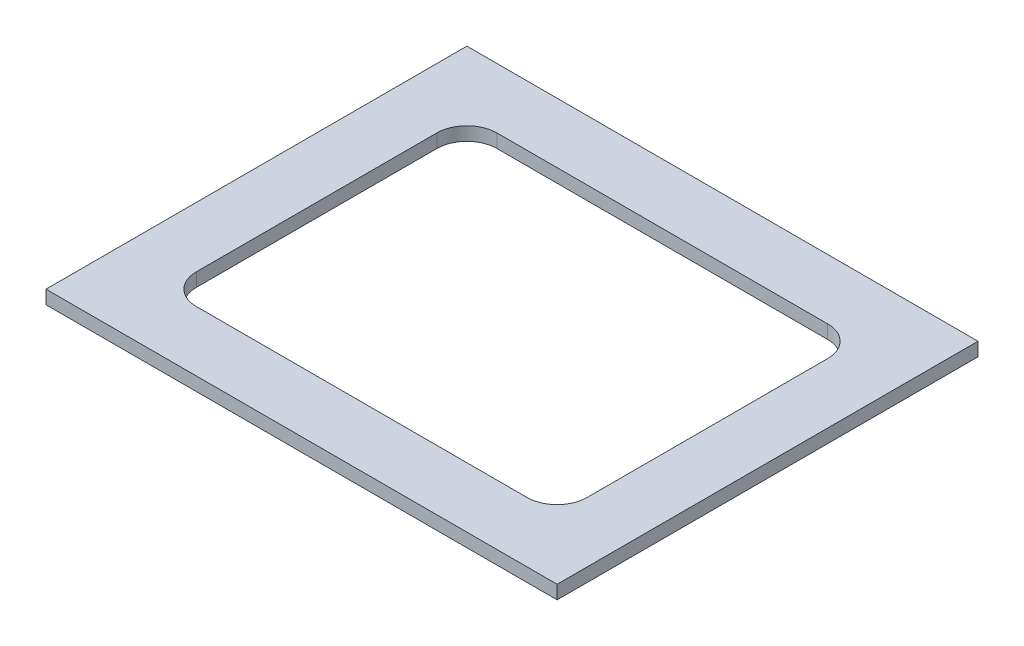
ISO-10303-21;
HEADER;
FILE_DESCRIPTION(('STEP AP214'),'2;1');
FILE_NAME('part.step','',(''),(''),'','','');
FILE_SCHEMA(('AUTOMOTIVE_DESIGN { 1 0 10303 214 1 1 1 1 }'));
ENDSEC;
DATA;
#1=APPLICATION_CONTEXT('core data for automotive mechanical design processes');
#2=APPLICATION_PROTOCOL_DEFINITION('international standard','automotive_design',2000,#1);
#3=PRODUCT_CONTEXT('',#1,'mechanical');
#4=PRODUCT('Part','Part','',(#3));
#5=PRODUCT_RELATED_PRODUCT_CATEGORY('part','',(#4));
#6=PRODUCT_DEFINITION_FORMATION('','',#4);
#7=PRODUCT_DEFINITION_CONTEXT('part definition',#1,'design');
#8=PRODUCT_DEFINITION('design','',#6,#7);
#9=PRODUCT_DEFINITION_SHAPE('','',#8);
#10=(LENGTH_UNIT() NAMED_UNIT(*) SI_UNIT(.MILLI.,.METRE.));
#11=(NAMED_UNIT(*) PLANE_ANGLE_UNIT() SI_UNIT($,.RADIAN.));
#12=(NAMED_UNIT(*) SI_UNIT($,.STERADIAN.) SOLID_ANGLE_UNIT());
#13=UNCERTAINTY_MEASURE_WITH_UNIT(LENGTH_MEASURE(1.E-05),#10,'distance_accuracy_value','');
#14=(GEOMETRIC_REPRESENTATION_CONTEXT(3) GLOBAL_UNCERTAINTY_ASSIGNED_CONTEXT((#13)) GLOBAL_UNIT_ASSIGNED_CONTEXT((#10,
#11,#12)) REPRESENTATION_CONTEXT('',''));
#15=CARTESIAN_POINT('',(0.,0.,0.));
#16=DIRECTION('',(0.,0.,1.));
#17=DIRECTION('',(1.,0.,0.));
#18=AXIS2_PLACEMENT_3D('',#15,#16,#17);
#19=CARTESIAN_POINT('',(0.,4.5,0.));
#20=DIRECTION('',(0.,1.,0.));
#21=DIRECTION('',(0.,0.,1.));
#22=AXIS2_PLACEMENT_3D('',#19,#20,#21);
#23=PLANE('',#22);
#24=DIRECTION('',(0.,0.,-1.));
#25=VECTOR('',#24,1.);
#26=CARTESIAN_POINT('',(38.6363636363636,4.5,-71.9471744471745));
#27=LINE('',#26,#25);
#28=CARTESIAN_POINT('',(38.6363636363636,4.5,68.0528255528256));
#29=VERTEX_POINT('',#28);
#30=CARTESIAN_POINT('',(38.6363636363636,4.5,-71.9471744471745));
#31=VERTEX_POINT('',#30);
#32=EDGE_CURVE('E171',#29,#31,#27,.T.);
#33=ORIENTED_EDGE('',*,*,#32,.T.);
#34=DIRECTION('',(-1.,0.,0.));
#35=VECTOR('',#34,1.);
#36=CARTESIAN_POINT('',(-131.363636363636,4.5,-71.9471744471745));
#37=LINE('',#36,#35);
#38=CARTESIAN_POINT('',(-131.363636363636,4.5,-71.9471744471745));
#39=VERTEX_POINT('',#38);
#40=EDGE_CURVE('E174',#31,#39,#37,.T.);
#41=ORIENTED_EDGE('',*,*,#40,.T.);
#42=DIRECTION('',(0.,0.,1.));
#43=VECTOR('',#42,1.);
#44=CARTESIAN_POINT('',(-131.363636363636,4.5,-71.9471744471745));
#45=LINE('',#44,#43);
#46=CARTESIAN_POINT('',(-131.363636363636,4.5,68.0528255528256));
#47=VERTEX_POINT('',#46);
#48=EDGE_CURVE('E177',#39,#47,#45,.T.);
#49=ORIENTED_EDGE('',*,*,#48,.T.);
#50=DIRECTION('',(1.,0.,0.));
#51=VECTOR('',#50,1.);
#52=CARTESIAN_POINT('',(-131.363636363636,4.5,68.0528255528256));
#53=LINE('',#52,#51);
#54=EDGE_CURVE('E179',#47,#29,#53,.T.);
#55=ORIENTED_EDGE('',*,*,#54,.T.);
#56=EDGE_LOOP('',(#33,#41,#49,#55));
#57=FACE_BOUND('',#56,.T.);
#58=DIRECTION('',(1.,0.,0.));
#59=VECTOR('',#58,1.);
#60=CARTESIAN_POINT('',(-101.363636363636,4.5,48.0528255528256));
#61=LINE('',#60,#59);
#62=CARTESIAN_POINT('',(-101.363636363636,4.5,48.0528255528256));
#63=VERTEX_POINT('',#62);
#64=CARTESIAN_POINT('',(8.63636363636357,4.5,48.0528255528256));
#65=VERTEX_POINT('',#64);
#66=EDGE_CURVE('E114',#63,#65,#61,.T.);
#67=ORIENTED_EDGE('',*,*,#66,.F.);
#68=CARTESIAN_POINT('',(-101.363636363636,4.5,38.0528255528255));
#69=DIRECTION('',(0.,1.,0.));
#70=DIRECTION('',(0.,0.,-1.));
#71=AXIS2_PLACEMENT_3D('',#68,#69,#70);
#72=CIRCLE('',#71,10.);
#73=CARTESIAN_POINT('',(-111.363636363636,4.5,38.0528255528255));
#74=VERTEX_POINT('',#73);
#75=EDGE_CURVE('E106',#74,#63,#72,.T.);
#76=ORIENTED_EDGE('',*,*,#75,.F.);
#77=DIRECTION('',(0.,0.,1.));
#78=VECTOR('',#77,1.);
#79=CARTESIAN_POINT('',(-111.363636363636,4.5,38.0528255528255));
#80=LINE('',#79,#78);
#81=CARTESIAN_POINT('',(-111.363636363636,4.5,-41.9471744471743));
#82=VERTEX_POINT('',#81);
#83=EDGE_CURVE('E139',#82,#74,#80,.T.);
#84=ORIENTED_EDGE('',*,*,#83,.F.);
#85=CARTESIAN_POINT('',(-101.363636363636,4.5,-41.9471744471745));
#86=DIRECTION('',(0.,1.,0.));
#87=DIRECTION('',(0.,0.,-1.));
#88=AXIS2_PLACEMENT_3D('',#85,#86,#87);
#89=CIRCLE('',#88,10.);
#90=CARTESIAN_POINT('',(-101.363636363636,4.5,-51.9471744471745));
#91=VERTEX_POINT('',#90);
#92=EDGE_CURVE('E137',#91,#82,#89,.T.);
#93=ORIENTED_EDGE('',*,*,#92,.F.);
#94=DIRECTION('',(-1.,0.,0.));
#95=VECTOR('',#94,1.);
#96=CARTESIAN_POINT('',(-101.363636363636,4.5,-51.9471744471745));
#97=LINE('',#96,#95);
#98=CARTESIAN_POINT('',(8.63636363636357,4.5,-51.9471744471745));
#99=VERTEX_POINT('',#98);
#100=EDGE_CURVE('E135',#99,#91,#97,.T.);
#101=ORIENTED_EDGE('',*,*,#100,.F.);
#102=CARTESIAN_POINT('',(8.63636363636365,4.5,-41.9471744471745));
#103=DIRECTION('',(0.,1.,0.));
#104=DIRECTION('',(0.,0.,-1.));
#105=AXIS2_PLACEMENT_3D('',#102,#103,#104);
#106=CIRCLE('',#105,10.);
#107=CARTESIAN_POINT('',(18.6363636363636,4.5,-41.9471744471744));
#108=VERTEX_POINT('',#107);
#109=EDGE_CURVE('E133',#108,#99,#106,.T.);
#110=ORIENTED_EDGE('',*,*,#109,.F.);
#111=DIRECTION('',(0.,0.,-1.));
#112=VECTOR('',#111,1.);
#113=CARTESIAN_POINT('',(18.6363636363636,4.5,38.0528255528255));
#114=LINE('',#113,#112);
#115=CARTESIAN_POINT('',(18.6363636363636,4.5,38.0528255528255));
#116=VERTEX_POINT('',#115);
#117=EDGE_CURVE('E129',#116,#108,#114,.T.);
#118=ORIENTED_EDGE('',*,*,#117,.F.);
#119=CARTESIAN_POINT('',(8.63636363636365,4.5,38.0528255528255));
#120=DIRECTION('',(0.,1.,0.));
#121=DIRECTION('',(0.,0.,1.));
#122=AXIS2_PLACEMENT_3D('',#119,#120,#121);
#123=CIRCLE('',#122,10.);
#124=EDGE_CURVE('E127',#65,#116,#123,.T.);
#125=ORIENTED_EDGE('',*,*,#124,.F.);
#126=EDGE_LOOP('',(#67,#76,#84,#93,#101,#110,#118,#125));
#127=FACE_BOUND('',#126,.T.);
#128=ADVANCED_FACE('F17',(#57,#127),#23,.T.);
#129=CARTESIAN_POINT('',(0.,0.,0.));
#130=DIRECTION('',(0.,1.,0.));
#131=DIRECTION('',(0.,0.,1.));
#132=AXIS2_PLACEMENT_3D('',#129,#130,#131);
#133=PLANE('',#132);
#134=DIRECTION('',(0.,0.,-1.));
#135=VECTOR('',#134,1.);
#136=CARTESIAN_POINT('',(38.6363636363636,0.,-71.9471744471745));
#137=LINE('',#136,#135);
#138=CARTESIAN_POINT('',(38.6363636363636,0.,68.0528255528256));
#139=VERTEX_POINT('',#138);
#140=CARTESIAN_POINT('',(38.6363636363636,0.,-71.9471744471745));
#141=VERTEX_POINT('',#140);
#142=EDGE_CURVE('E122',#139,#141,#137,.T.);
#143=ORIENTED_EDGE('',*,*,#142,.F.);
#144=DIRECTION('',(1.,0.,0.));
#145=VECTOR('',#144,1.);
#146=CARTESIAN_POINT('',(-131.363636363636,0.,68.0528255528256));
#147=LINE('',#146,#145);
#148=CARTESIAN_POINT('',(-131.363636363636,0.,68.0528255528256));
#149=VERTEX_POINT('',#148);
#150=EDGE_CURVE('E175',#149,#139,#147,.T.);
#151=ORIENTED_EDGE('',*,*,#150,.F.);
#152=DIRECTION('',(0.,0.,1.));
#153=VECTOR('',#152,1.);
#154=CARTESIAN_POINT('',(-131.363636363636,0.,-71.9471744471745));
#155=LINE('',#154,#153);
#156=CARTESIAN_POINT('',(-131.363636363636,0.,-71.9471744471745));
#157=VERTEX_POINT('',#156);
#158=EDGE_CURVE('E186',#157,#149,#155,.T.);
#159=ORIENTED_EDGE('',*,*,#158,.F.);
#160=DIRECTION('',(-1.,0.,0.));
#161=VECTOR('',#160,1.);
#162=CARTESIAN_POINT('',(-131.363636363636,0.,-71.9471744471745));
#163=LINE('',#162,#161);
#164=EDGE_CURVE('E184',#141,#157,#163,.T.);
#165=ORIENTED_EDGE('',*,*,#164,.F.);
#166=EDGE_LOOP('',(#143,#151,#159,#165));
#167=FACE_BOUND('',#166,.T.);
#168=CARTESIAN_POINT('',(-101.363636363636,0.,38.0528255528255));
#169=DIRECTION('',(0.,1.,0.));
#170=DIRECTION('',(0.,0.,-1.));
#171=AXIS2_PLACEMENT_3D('',#168,#169,#170);
#172=CIRCLE('',#171,10.);
#173=CARTESIAN_POINT('',(-111.363636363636,0.,38.0528255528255));
#174=VERTEX_POINT('',#173);
#175=CARTESIAN_POINT('',(-101.363636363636,0.,48.0528255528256));
#176=VERTEX_POINT('',#175);
#177=EDGE_CURVE('E40',#174,#176,#172,.T.);
#178=ORIENTED_EDGE('',*,*,#177,.T.);
#179=DIRECTION('',(1.,0.,0.));
#180=VECTOR('',#179,1.);
#181=CARTESIAN_POINT('',(-101.363636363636,0.,48.0528255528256));
#182=LINE('',#181,#180);
#183=CARTESIAN_POINT('',(8.63636363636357,0.,48.0528255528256));
#184=VERTEX_POINT('',#183);
#185=EDGE_CURVE('E121',#176,#184,#182,.T.);
#186=ORIENTED_EDGE('',*,*,#185,.T.);
#187=CARTESIAN_POINT('',(8.63636363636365,0.,38.0528255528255));
#188=DIRECTION('',(0.,1.,0.));
#189=DIRECTION('',(0.,0.,1.));
#190=AXIS2_PLACEMENT_3D('',#187,#188,#189);
#191=CIRCLE('',#190,10.);
#192=CARTESIAN_POINT('',(18.6363636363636,0.,38.0528255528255));
#193=VERTEX_POINT('',#192);
#194=EDGE_CURVE('E143',#184,#193,#191,.T.);
#195=ORIENTED_EDGE('',*,*,#194,.T.);
#196=DIRECTION('',(0.,0.,-1.));
#197=VECTOR('',#196,1.);
#198=CARTESIAN_POINT('',(18.6363636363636,0.,38.0528255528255));
#199=LINE('',#198,#197);
#200=CARTESIAN_POINT('',(18.6363636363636,0.,-41.9471744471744));
#201=VERTEX_POINT('',#200);
#202=EDGE_CURVE('E146',#193,#201,#199,.T.);
#203=ORIENTED_EDGE('',*,*,#202,.T.);
#204=CARTESIAN_POINT('',(8.63636363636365,0.,-41.9471744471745));
#205=DIRECTION('',(0.,1.,0.));
#206=DIRECTION('',(0.,0.,-1.));
#207=AXIS2_PLACEMENT_3D('',#204,#205,#206);
#208=CIRCLE('',#207,10.);
#209=CARTESIAN_POINT('',(8.63636363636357,0.,-51.9471744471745));
#210=VERTEX_POINT('',#209);
#211=EDGE_CURVE('E149',#201,#210,#208,.T.);
#212=ORIENTED_EDGE('',*,*,#211,.T.);
#213=DIRECTION('',(-1.,0.,0.));
#214=VECTOR('',#213,1.);
#215=CARTESIAN_POINT('',(-101.363636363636,0.,-51.9471744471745));
#216=LINE('',#215,#214);
#217=CARTESIAN_POINT('',(-101.363636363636,0.,-51.9471744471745));
#218=VERTEX_POINT('',#217);
#219=EDGE_CURVE('E152',#210,#218,#216,.T.);
#220=ORIENTED_EDGE('',*,*,#219,.T.);
#221=CARTESIAN_POINT('',(-101.363636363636,0.,-41.9471744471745));
#222=DIRECTION('',(0.,1.,0.));
#223=DIRECTION('',(0.,0.,-1.));
#224=AXIS2_PLACEMENT_3D('',#221,#222,#223);
#225=CIRCLE('',#224,10.);
#226=CARTESIAN_POINT('',(-111.363636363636,0.,-41.9471744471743));
#227=VERTEX_POINT('',#226);
#228=EDGE_CURVE('E155',#218,#227,#225,.T.);
#229=ORIENTED_EDGE('',*,*,#228,.T.);
#230=DIRECTION('',(0.,0.,1.));
#231=VECTOR('',#230,1.);
#232=CARTESIAN_POINT('',(-111.363636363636,0.,38.0528255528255));
#233=LINE('',#232,#231);
#234=EDGE_CURVE('E115',#227,#174,#233,.T.);
#235=ORIENTED_EDGE('',*,*,#234,.T.);
#236=EDGE_LOOP('',(#178,#186,#195,#203,#212,#220,#229,#235));
#237=FACE_BOUND('',#236,.T.);
#238=ADVANCED_FACE('F204',(#167,#237),#133,.F.);
#239=CARTESIAN_POINT('',(38.6363636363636,4.5,-71.9471744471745));
#240=DIRECTION('',(-1.,0.,0.));
#241=DIRECTION('',(0.,0.,1.));
#242=AXIS2_PLACEMENT_3D('',#239,#240,#241);
#243=PLANE('',#242);
#244=ORIENTED_EDGE('',*,*,#142,.T.);
#245=DIRECTION('',(0.,-1.,0.));
#246=VECTOR('',#245,1.);
#247=CARTESIAN_POINT('',(38.6363636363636,4.5,-71.9471744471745));
#248=LINE('',#247,#246);
#249=EDGE_CURVE('E11',#31,#141,#248,.T.);
#250=ORIENTED_EDGE('',*,*,#249,.F.);
#251=ORIENTED_EDGE('',*,*,#32,.F.);
#252=DIRECTION('',(0.,-1.,0.));
#253=VECTOR('',#252,1.);
#254=CARTESIAN_POINT('',(38.6363636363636,4.5,68.0528255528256));
#255=LINE('',#254,#253);
#256=EDGE_CURVE('E181',#29,#139,#255,.T.);
#257=ORIENTED_EDGE('',*,*,#256,.T.);
#258=EDGE_LOOP('',(#244,#250,#251,#257));
#259=FACE_BOUND('',#258,.T.);
#260=ADVANCED_FACE('F19',(#259),#243,.F.);
#261=CARTESIAN_POINT('',(-131.363636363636,4.5,-71.9471744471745));
#262=DIRECTION('',(0.,0.,1.));
#263=DIRECTION('',(1.,0.,0.));
#264=AXIS2_PLACEMENT_3D('',#261,#262,#263);
#265=PLANE('',#264);
#266=ORIENTED_EDGE('',*,*,#164,.T.);
#267=DIRECTION('',(0.,-1.,0.));
#268=VECTOR('',#267,1.);
#269=CARTESIAN_POINT('',(-131.363636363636,4.5,-71.9471744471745));
#270=LINE('',#269,#268);
#271=EDGE_CURVE('E25',#39,#157,#270,.T.);
#272=ORIENTED_EDGE('',*,*,#271,.F.);
#273=ORIENTED_EDGE('',*,*,#40,.F.);
#274=ORIENTED_EDGE('',*,*,#249,.T.);
#275=EDGE_LOOP('',(#266,#272,#273,#274));
#276=FACE_BOUND('',#275,.T.);
#277=ADVANCED_FACE('F214',(#276),#265,.F.);
#278=CARTESIAN_POINT('',(-131.363636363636,4.5,-71.9471744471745));
#279=DIRECTION('',(1.,0.,0.));
#280=DIRECTION('',(0.,0.,-1.));
#281=AXIS2_PLACEMENT_3D('',#278,#279,#280);
#282=PLANE('',#281);
#283=ORIENTED_EDGE('',*,*,#158,.T.);
#284=DIRECTION('',(0.,-1.,0.));
#285=VECTOR('',#284,1.);
#286=CARTESIAN_POINT('',(-131.363636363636,4.5,68.0528255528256));
#287=LINE('',#286,#285);
#288=EDGE_CURVE('E191',#47,#149,#287,.T.);
#289=ORIENTED_EDGE('',*,*,#288,.F.);
#290=ORIENTED_EDGE('',*,*,#48,.F.);
#291=ORIENTED_EDGE('',*,*,#271,.T.);
#292=EDGE_LOOP('',(#283,#289,#290,#291));
#293=FACE_BOUND('',#292,.T.);
#294=ADVANCED_FACE('F198',(#293),#282,.F.);
#295=CARTESIAN_POINT('',(-131.363636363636,4.5,68.0528255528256));
#296=DIRECTION('',(0.,0.,-1.));
#297=DIRECTION('',(-1.,0.,0.));
#298=AXIS2_PLACEMENT_3D('',#295,#296,#297);
#299=PLANE('',#298);
#300=ORIENTED_EDGE('',*,*,#150,.T.);
#301=ORIENTED_EDGE('',*,*,#256,.F.);
#302=ORIENTED_EDGE('',*,*,#54,.F.);
#303=ORIENTED_EDGE('',*,*,#288,.T.);
#304=EDGE_LOOP('',(#300,#301,#302,#303));
#305=FACE_BOUND('',#304,.T.);
#306=ADVANCED_FACE('F208',(#305),#299,.F.);
#307=CARTESIAN_POINT('',(-101.363636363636,4.5,38.0528255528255));
#308=DIRECTION('',(0.,-1.,0.));
#309=DIRECTION('',(0.,0.,-1.));
#310=AXIS2_PLACEMENT_3D('',#307,#308,#309);
#311=CYLINDRICAL_SURFACE('',#310,10.);
#312=ORIENTED_EDGE('',*,*,#177,.F.);
#313=DIRECTION('',(0.,-1.,0.));
#314=VECTOR('',#313,1.);
#315=CARTESIAN_POINT('',(-111.363636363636,4.5,38.0528255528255));
#316=LINE('',#315,#314);
#317=EDGE_CURVE('E110',#74,#174,#316,.T.);
#318=ORIENTED_EDGE('',*,*,#317,.F.);
#319=ORIENTED_EDGE('',*,*,#75,.T.);
#320=DIRECTION('',(0.,-1.,0.));
#321=VECTOR('',#320,1.);
#322=CARTESIAN_POINT('',(-101.363636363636,4.5,48.0528255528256));
#323=LINE('',#322,#321);
#324=EDGE_CURVE('E109',#63,#176,#323,.T.);
#325=ORIENTED_EDGE('',*,*,#324,.T.);
#326=EDGE_LOOP('',(#312,#318,#319,#325));
#327=FACE_BOUND('',#326,.T.);
#328=ADVANCED_FACE('F108',(#327),#311,.F.);
#329=CARTESIAN_POINT('',(-101.363636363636,4.5,48.0528255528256));
#330=DIRECTION('',(0.,0.,-1.));
#331=DIRECTION('',(-1.,0.,0.));
#332=AXIS2_PLACEMENT_3D('',#329,#330,#331);
#333=PLANE('',#332);
#334=ORIENTED_EDGE('',*,*,#185,.F.);
#335=ORIENTED_EDGE('',*,*,#324,.F.);
#336=ORIENTED_EDGE('',*,*,#66,.T.);
#337=DIRECTION('',(0.,-1.,0.));
#338=VECTOR('',#337,1.);
#339=CARTESIAN_POINT('',(8.63636363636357,4.5,48.0528255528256));
#340=LINE('',#339,#338);
#341=EDGE_CURVE('E123',#65,#184,#340,.T.);
#342=ORIENTED_EDGE('',*,*,#341,.T.);
#343=EDGE_LOOP('',(#334,#335,#336,#342));
#344=FACE_BOUND('',#343,.T.);
#345=ADVANCED_FACE('F118',(#344),#333,.T.);
#346=CARTESIAN_POINT('',(8.63636363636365,4.5,38.0528255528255));
#347=DIRECTION('',(0.,-1.,0.));
#348=DIRECTION('',(0.,0.,-1.));
#349=AXIS2_PLACEMENT_3D('',#346,#347,#348);
#350=CYLINDRICAL_SURFACE('',#349,10.);
#351=ORIENTED_EDGE('',*,*,#194,.F.);
#352=ORIENTED_EDGE('',*,*,#341,.F.);
#353=ORIENTED_EDGE('',*,*,#124,.T.);
#354=DIRECTION('',(0.,-1.,0.));
#355=VECTOR('',#354,1.);
#356=CARTESIAN_POINT('',(18.6363636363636,4.5,38.0528255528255));
#357=LINE('',#356,#355);
#358=EDGE_CURVE('E168',#116,#193,#357,.T.);
#359=ORIENTED_EDGE('',*,*,#358,.T.);
#360=EDGE_LOOP('',(#351,#352,#353,#359));
#361=FACE_BOUND('',#360,.T.);
#362=ADVANCED_FACE('F242',(#361),#350,.F.);
#363=CARTESIAN_POINT('',(18.6363636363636,4.5,38.0528255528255));
#364=DIRECTION('',(-1.,0.,0.));
#365=DIRECTION('',(0.,0.,1.));
#366=AXIS2_PLACEMENT_3D('',#363,#364,#365);
#367=PLANE('',#366);
#368=ORIENTED_EDGE('',*,*,#202,.F.);
#369=ORIENTED_EDGE('',*,*,#358,.F.);
#370=ORIENTED_EDGE('',*,*,#117,.T.);
#371=DIRECTION('',(0.,-1.,0.));
#372=VECTOR('',#371,1.);
#373=CARTESIAN_POINT('',(18.6363636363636,4.5,-41.9471744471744));
#374=LINE('',#373,#372);
#375=EDGE_CURVE('E166',#108,#201,#374,.T.);
#376=ORIENTED_EDGE('',*,*,#375,.T.);
#377=EDGE_LOOP('',(#368,#369,#370,#376));
#378=FACE_BOUND('',#377,.T.);
#379=ADVANCED_FACE('F247',(#378),#367,.T.);
#380=CARTESIAN_POINT('',(8.63636363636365,4.5,-41.9471744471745));
#381=DIRECTION('',(0.,-1.,0.));
#382=DIRECTION('',(0.,0.,-1.));
#383=AXIS2_PLACEMENT_3D('',#380,#381,#382);
#384=CYLINDRICAL_SURFACE('',#383,10.);
#385=ORIENTED_EDGE('',*,*,#211,.F.);
#386=ORIENTED_EDGE('',*,*,#375,.F.);
#387=ORIENTED_EDGE('',*,*,#109,.T.);
#388=DIRECTION('',(0.,-1.,0.));
#389=VECTOR('',#388,1.);
#390=CARTESIAN_POINT('',(8.63636363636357,4.5,-51.9471744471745));
#391=LINE('',#390,#389);
#392=EDGE_CURVE('E164',#99,#210,#391,.T.);
#393=ORIENTED_EDGE('',*,*,#392,.T.);
#394=EDGE_LOOP('',(#385,#386,#387,#393));
#395=FACE_BOUND('',#394,.T.);
#396=ADVANCED_FACE('F253',(#395),#384,.F.);
#397=CARTESIAN_POINT('',(-101.363636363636,4.5,-51.9471744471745));
#398=DIRECTION('',(0.,0.,1.));
#399=DIRECTION('',(1.,0.,0.));
#400=AXIS2_PLACEMENT_3D('',#397,#398,#399);
#401=PLANE('',#400);
#402=ORIENTED_EDGE('',*,*,#219,.F.);
#403=ORIENTED_EDGE('',*,*,#392,.F.);
#404=ORIENTED_EDGE('',*,*,#100,.T.);
#405=DIRECTION('',(0.,-1.,0.));
#406=VECTOR('',#405,1.);
#407=CARTESIAN_POINT('',(-101.363636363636,4.5,-51.9471744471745));
#408=LINE('',#407,#406);
#409=EDGE_CURVE('E162',#91,#218,#408,.T.);
#410=ORIENTED_EDGE('',*,*,#409,.T.);
#411=EDGE_LOOP('',(#402,#403,#404,#410));
#412=FACE_BOUND('',#411,.T.);
#413=ADVANCED_FACE('F257',(#412),#401,.T.);
#414=CARTESIAN_POINT('',(-101.363636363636,4.5,-41.9471744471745));
#415=DIRECTION('',(0.,-1.,0.));
#416=DIRECTION('',(0.,0.,-1.));
#417=AXIS2_PLACEMENT_3D('',#414,#415,#416);
#418=CYLINDRICAL_SURFACE('',#417,10.);
#419=ORIENTED_EDGE('',*,*,#228,.F.);
#420=ORIENTED_EDGE('',*,*,#409,.F.);
#421=ORIENTED_EDGE('',*,*,#92,.T.);
#422=DIRECTION('',(0.,-1.,0.));
#423=VECTOR('',#422,1.);
#424=CARTESIAN_POINT('',(-111.363636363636,4.5,-41.9471744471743));
#425=LINE('',#424,#423);
#426=EDGE_CURVE('E32',#82,#227,#425,.T.);
#427=ORIENTED_EDGE('',*,*,#426,.T.);
#428=EDGE_LOOP('',(#419,#420,#421,#427));
#429=FACE_BOUND('',#428,.T.);
#430=ADVANCED_FACE('F261',(#429),#418,.F.);
#431=CARTESIAN_POINT('',(-111.363636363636,4.5,38.0528255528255));
#432=DIRECTION('',(1.,0.,0.));
#433=DIRECTION('',(0.,0.,-1.));
#434=AXIS2_PLACEMENT_3D('',#431,#432,#433);
#435=PLANE('',#434);
#436=ORIENTED_EDGE('',*,*,#234,.F.);
#437=ORIENTED_EDGE('',*,*,#426,.F.);
#438=ORIENTED_EDGE('',*,*,#83,.T.);
#439=ORIENTED_EDGE('',*,*,#317,.T.);
#440=EDGE_LOOP('',(#436,#437,#438,#439));
#441=FACE_BOUND('',#440,.T.);
#442=ADVANCED_FACE('F265',(#441),#435,.T.);
#443=CLOSED_SHELL('',(#128,#238,#260,#277,#294,#306,#328,#345,#362,#379,#396,#413,#430,#442));
#444=MANIFOLD_SOLID_BREP('B1',#443);
#445=ADVANCED_BREP_SHAPE_REPRESENTATION('',(#18,#444),#14);
#446=SHAPE_DEFINITION_REPRESENTATION(#9,#445);
ENDSEC;
END-ISO-10303-21;
